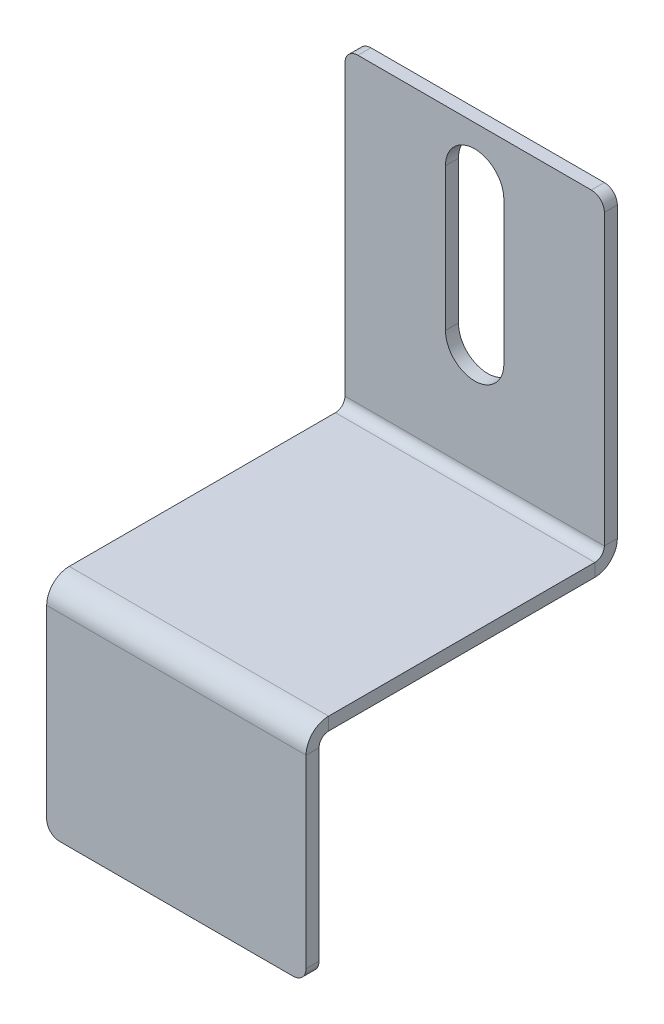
ISO-10303-21;
HEADER;
FILE_DESCRIPTION(('STEP AP214'),'2;1');
FILE_NAME('part.step','',(''),(''),'','','');
FILE_SCHEMA(('AUTOMOTIVE_DESIGN { 1 0 10303 214 1 1 1 1 }'));
ENDSEC;
DATA;
#1=APPLICATION_CONTEXT('core data for automotive mechanical design processes');
#2=APPLICATION_PROTOCOL_DEFINITION('international standard','automotive_design',2000,#1);
#3=PRODUCT_CONTEXT('',#1,'mechanical');
#4=PRODUCT('Part','Part','',(#3));
#5=PRODUCT_RELATED_PRODUCT_CATEGORY('part','',(#4));
#6=PRODUCT_DEFINITION_FORMATION('','',#4);
#7=PRODUCT_DEFINITION_CONTEXT('part definition',#1,'design');
#8=PRODUCT_DEFINITION('design','',#6,#7);
#9=PRODUCT_DEFINITION_SHAPE('','',#8);
#10=(LENGTH_UNIT() NAMED_UNIT(*) SI_UNIT(.MILLI.,.METRE.));
#11=(NAMED_UNIT(*) PLANE_ANGLE_UNIT() SI_UNIT($,.RADIAN.));
#12=(NAMED_UNIT(*) SI_UNIT($,.STERADIAN.) SOLID_ANGLE_UNIT());
#13=UNCERTAINTY_MEASURE_WITH_UNIT(LENGTH_MEASURE(1.E-05),#10,'distance_accuracy_value','');
#14=(GEOMETRIC_REPRESENTATION_CONTEXT(3) GLOBAL_UNCERTAINTY_ASSIGNED_CONTEXT((#13)) GLOBAL_UNIT_ASSIGNED_CONTEXT((#10,
#11,#12)) REPRESENTATION_CONTEXT('',''));
#15=CARTESIAN_POINT('',(0.,0.,0.));
#16=DIRECTION('',(0.,0.,1.));
#17=DIRECTION('',(1.,0.,0.));
#18=AXIS2_PLACEMENT_3D('',#15,#16,#17);
#19=CARTESIAN_POINT('',(20.,-25.,1.7366));
#20=DIRECTION('',(1.,0.,0.));
#21=DIRECTION('',(0.,0.,-1.));
#22=AXIS2_PLACEMENT_3D('',#19,#20,#21);
#23=PLANE('',#22);
#24=DIRECTION('',(0.,1.,0.));
#25=VECTOR('',#24,1.);
#26=CARTESIAN_POINT('',(20.,-25.,1.7366));
#27=LINE('',#26,#25);
#28=CARTESIAN_POINT('',(20.,-25.,1.7366));
#29=VERTEX_POINT('',#28);
#30=CARTESIAN_POINT('',(20.,-24.,1.7366));
#31=VERTEX_POINT('',#30);
#32=EDGE_CURVE('E309',#29,#31,#27,.T.);
#33=ORIENTED_EDGE('',*,*,#32,.F.);
#34=CARTESIAN_POINT('',(20.,-23.2634,1.7366));
#35=DIRECTION('',(1.,0.,0.));
#36=DIRECTION('',(0.,0.,-1.));
#37=AXIS2_PLACEMENT_3D('',#34,#35,#36);
#38=CIRCLE('',#37,1.7366);
#39=CARTESIAN_POINT('',(20.,-23.2634,0.));
#40=VERTEX_POINT('',#39);
#41=EDGE_CURVE('E215',#40,#29,#38,.F.);
#42=ORIENTED_EDGE('',*,*,#41,.F.);
#43=DIRECTION('',(0.,0.,-1.));
#44=VECTOR('',#43,1.);
#45=CARTESIAN_POINT('',(20.,-23.2634,0.999999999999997));
#46=LINE('',#45,#44);
#47=CARTESIAN_POINT('',(20.,-23.2634,0.999999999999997));
#48=VERTEX_POINT('',#47);
#49=EDGE_CURVE('E306',#48,#40,#46,.T.);
#50=ORIENTED_EDGE('',*,*,#49,.F.);
#51=CARTESIAN_POINT('',(20.,-23.2634,1.7366));
#52=DIRECTION('',(1.,0.,0.));
#53=DIRECTION('',(0.,0.,-1.));
#54=AXIS2_PLACEMENT_3D('',#51,#52,#53);
#55=CIRCLE('',#54,0.7366);
#56=EDGE_CURVE('E222',#48,#31,#55,.F.);
#57=ORIENTED_EDGE('',*,*,#56,.T.);
#58=EDGE_LOOP('',(#33,#42,#50,#57));
#59=FACE_BOUND('',#58,.T.);
#60=ADVANCED_FACE('F36',(#59),#23,.T.);
#61=CARTESIAN_POINT('',(20.,-23.2634,0.999999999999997));
#62=DIRECTION('',(1.,0.,0.));
#63=DIRECTION('',(0.,0.,-1.));
#64=AXIS2_PLACEMENT_3D('',#61,#62,#63);
#65=PLANE('',#64);
#66=DIRECTION('',(0.,0.,1.));
#67=VECTOR('',#66,1.);
#68=CARTESIAN_POINT('',(20.,-25.,0.));
#69=LINE('',#68,#67);
#70=CARTESIAN_POINT('',(20.,-25.,22.2634));
#71=VERTEX_POINT('',#70);
#72=EDGE_CURVE('E212',#29,#71,#69,.T.);
#73=ORIENTED_EDGE('',*,*,#72,.F.);
#74=ORIENTED_EDGE('',*,*,#32,.T.);
#75=DIRECTION('',(0.,0.,-1.));
#76=VECTOR('',#75,1.);
#77=CARTESIAN_POINT('',(20.,-24.,0.));
#78=LINE('',#77,#76);
#79=CARTESIAN_POINT('',(20.,-24.,22.2634));
#80=VERTEX_POINT('',#79);
#81=EDGE_CURVE('E225',#31,#80,#78,.F.);
#82=ORIENTED_EDGE('',*,*,#81,.T.);
#83=DIRECTION('',(0.,-1.,0.));
#84=VECTOR('',#83,1.);
#85=CARTESIAN_POINT('',(20.,-24.,22.2634));
#86=LINE('',#85,#84);
#87=EDGE_CURVE('E297',#80,#71,#86,.T.);
#88=ORIENTED_EDGE('',*,*,#87,.T.);
#89=EDGE_LOOP('',(#73,#74,#82,#88));
#90=FACE_BOUND('',#89,.T.);
#91=ADVANCED_FACE('F369',(#90),#65,.T.);
#92=CARTESIAN_POINT('',(0.,-23.2634,0.));
#93=DIRECTION('',(-1.,0.,0.));
#94=DIRECTION('',(0.,0.,1.));
#95=AXIS2_PLACEMENT_3D('',#92,#93,#94);
#96=PLANE('',#95);
#97=DIRECTION('',(0.,0.,1.));
#98=VECTOR('',#97,1.);
#99=CARTESIAN_POINT('',(0.,-23.2634,0.));
#100=LINE('',#99,#98);
#101=CARTESIAN_POINT('',(0.,-23.2634,0.));
#102=VERTEX_POINT('',#101);
#103=CARTESIAN_POINT('',(0.,-23.2634,0.999999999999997));
#104=VERTEX_POINT('',#103);
#105=EDGE_CURVE('E303',#102,#104,#100,.T.);
#106=ORIENTED_EDGE('',*,*,#105,.F.);
#107=CARTESIAN_POINT('',(0.,-23.2634,1.7366));
#108=DIRECTION('',(1.,0.,0.));
#109=DIRECTION('',(0.,0.,-1.));
#110=AXIS2_PLACEMENT_3D('',#107,#108,#109);
#111=CIRCLE('',#110,1.7366);
#112=CARTESIAN_POINT('',(0.,-25.,1.7366));
#113=VERTEX_POINT('',#112);
#114=EDGE_CURVE('E243',#102,#113,#111,.F.);
#115=ORIENTED_EDGE('',*,*,#114,.T.);
#116=DIRECTION('',(0.,-1.,0.));
#117=VECTOR('',#116,1.);
#118=CARTESIAN_POINT('',(0.,-24.,1.7366));
#119=LINE('',#118,#117);
#120=CARTESIAN_POINT('',(0.,-24.,1.7366));
#121=VERTEX_POINT('',#120);
#122=EDGE_CURVE('E301',#121,#113,#119,.T.);
#123=ORIENTED_EDGE('',*,*,#122,.F.);
#124=CARTESIAN_POINT('',(0.,-23.2634,1.7366));
#125=DIRECTION('',(1.,0.,0.));
#126=DIRECTION('',(0.,0.,-1.));
#127=AXIS2_PLACEMENT_3D('',#124,#125,#126);
#128=CIRCLE('',#127,0.7366);
#129=EDGE_CURVE('E250',#104,#121,#128,.F.);
#130=ORIENTED_EDGE('',*,*,#129,.F.);
#131=EDGE_LOOP('',(#106,#115,#123,#130));
#132=FACE_BOUND('',#131,.T.);
#133=ADVANCED_FACE('F375',(#132),#96,.T.);
#134=CARTESIAN_POINT('',(0.,-24.,1.7366));
#135=DIRECTION('',(-1.,0.,0.));
#136=DIRECTION('',(0.,0.,1.));
#137=AXIS2_PLACEMENT_3D('',#134,#135,#136);
#138=PLANE('',#137);
#139=DIRECTION('',(0.,-1.,0.));
#140=VECTOR('',#139,1.);
#141=CARTESIAN_POINT('',(0.,0.,1.));
#142=LINE('',#141,#140);
#143=CARTESIAN_POINT('',(0.,-1.,1.));
#144=VERTEX_POINT('',#143);
#145=EDGE_CURVE('E248',#144,#104,#142,.T.);
#146=ORIENTED_EDGE('',*,*,#145,.F.);
#147=DIRECTION('',(0.,0.,-1.));
#148=VECTOR('',#147,1.);
#149=CARTESIAN_POINT('',(0.,-1.,1.7366));
#150=LINE('',#149,#148);
#151=CARTESIAN_POINT('',(0.,-1.,0.));
#152=VERTEX_POINT('',#151);
#153=EDGE_CURVE('E329',#144,#152,#150,.T.);
#154=ORIENTED_EDGE('',*,*,#153,.T.);
#155=DIRECTION('',(0.,-1.,0.));
#156=VECTOR('',#155,1.);
#157=CARTESIAN_POINT('',(0.,0.,0.));
#158=LINE('',#157,#156);
#159=EDGE_CURVE('E246',#152,#102,#158,.T.);
#160=ORIENTED_EDGE('',*,*,#159,.T.);
#161=ORIENTED_EDGE('',*,*,#105,.T.);
#162=EDGE_LOOP('',(#146,#154,#160,#161));
#163=FACE_BOUND('',#162,.T.);
#164=ADVANCED_FACE('F399',(#163),#138,.T.);
#165=CARTESIAN_POINT('',(20.,-25.7366,23.));
#166=DIRECTION('',(1.,0.,0.));
#167=DIRECTION('',(0.,0.,-1.));
#168=AXIS2_PLACEMENT_3D('',#165,#166,#167);
#169=PLANE('',#168);
#170=DIRECTION('',(0.,0.,1.));
#171=VECTOR('',#170,1.);
#172=CARTESIAN_POINT('',(20.,-25.7366,23.));
#173=LINE('',#172,#171);
#174=CARTESIAN_POINT('',(20.,-25.7366,23.));
#175=VERTEX_POINT('',#174);
#176=CARTESIAN_POINT('',(20.,-25.7366,24.));
#177=VERTEX_POINT('',#176);
#178=EDGE_CURVE('E299',#175,#177,#173,.T.);
#179=ORIENTED_EDGE('',*,*,#178,.F.);
#180=CARTESIAN_POINT('',(20.,-25.7366,22.2634));
#181=DIRECTION('',(-1.,0.,0.));
#182=DIRECTION('',(0.,0.,1.));
#183=AXIS2_PLACEMENT_3D('',#180,#181,#182);
#184=CIRCLE('',#183,0.7366);
#185=EDGE_CURVE('E209',#71,#175,#184,.F.);
#186=ORIENTED_EDGE('',*,*,#185,.F.);
#187=ORIENTED_EDGE('',*,*,#87,.F.);
#188=CARTESIAN_POINT('',(20.,-25.7366,22.2634));
#189=DIRECTION('',(1.,0.,0.));
#190=DIRECTION('',(0.,0.,-1.));
#191=AXIS2_PLACEMENT_3D('',#188,#189,#190);
#192=CIRCLE('',#191,1.7366);
#193=EDGE_CURVE('E228',#80,#177,#192,.T.);
#194=ORIENTED_EDGE('',*,*,#193,.T.);
#195=EDGE_LOOP('',(#179,#186,#187,#194));
#196=FACE_BOUND('',#195,.T.);
#197=ADVANCED_FACE('F442',(#196),#169,.T.);
#198=CARTESIAN_POINT('',(20.,-24.,22.2634));
#199=DIRECTION('',(1.,0.,0.));
#200=DIRECTION('',(0.,0.,-1.));
#201=AXIS2_PLACEMENT_3D('',#198,#199,#200);
#202=PLANE('',#201);
#203=DIRECTION('',(0.,-1.,0.));
#204=VECTOR('',#203,1.);
#205=CARTESIAN_POINT('',(20.,-25.,24.));
#206=LINE('',#205,#204);
#207=CARTESIAN_POINT('',(20.,-40.,24.));
#208=VERTEX_POINT('',#207);
#209=EDGE_CURVE('E202',#177,#208,#206,.T.);
#210=ORIENTED_EDGE('',*,*,#209,.T.);
#211=DIRECTION('',(0.,0.,1.));
#212=VECTOR('',#211,1.);
#213=CARTESIAN_POINT('',(20.,-40.,22.2634));
#214=LINE('',#213,#212);
#215=CARTESIAN_POINT('',(20.,-40.,23.));
#216=VERTEX_POINT('',#215);
#217=EDGE_CURVE('E327',#208,#216,#214,.F.);
#218=ORIENTED_EDGE('',*,*,#217,.T.);
#219=DIRECTION('',(0.,-1.,0.));
#220=VECTOR('',#219,1.);
#221=CARTESIAN_POINT('',(20.,-25.,23.));
#222=LINE('',#221,#220);
#223=EDGE_CURVE('E205',#175,#216,#222,.T.);
#224=ORIENTED_EDGE('',*,*,#223,.F.);
#225=ORIENTED_EDGE('',*,*,#178,.T.);
#226=EDGE_LOOP('',(#210,#218,#224,#225));
#227=FACE_BOUND('',#226,.T.);
#228=ADVANCED_FACE('F485',(#227),#202,.T.);
#229=CARTESIAN_POINT('',(0.,-25.,22.2634));
#230=DIRECTION('',(-1.,0.,0.));
#231=DIRECTION('',(0.,0.,1.));
#232=AXIS2_PLACEMENT_3D('',#229,#230,#231);
#233=PLANE('',#232);
#234=DIRECTION('',(0.,1.,0.));
#235=VECTOR('',#234,1.);
#236=CARTESIAN_POINT('',(0.,-25.,22.2634));
#237=LINE('',#236,#235);
#238=CARTESIAN_POINT('',(0.,-25.,22.2634));
#239=VERTEX_POINT('',#238);
#240=CARTESIAN_POINT('',(0.,-24.,22.2634));
#241=VERTEX_POINT('',#240);
#242=EDGE_CURVE('E295',#239,#241,#237,.T.);
#243=ORIENTED_EDGE('',*,*,#242,.F.);
#244=CARTESIAN_POINT('',(0.,-25.7366,22.2634));
#245=DIRECTION('',(-1.,0.,0.));
#246=DIRECTION('',(0.,0.,1.));
#247=AXIS2_PLACEMENT_3D('',#244,#245,#246);
#248=CIRCLE('',#247,0.7366);
#249=CARTESIAN_POINT('',(0.,-25.7366,23.));
#250=VERTEX_POINT('',#249);
#251=EDGE_CURVE('E237',#239,#250,#248,.F.);
#252=ORIENTED_EDGE('',*,*,#251,.T.);
#253=DIRECTION('',(0.,0.,-1.));
#254=VECTOR('',#253,1.);
#255=CARTESIAN_POINT('',(0.,-25.7366,24.));
#256=LINE('',#255,#254);
#257=CARTESIAN_POINT('',(0.,-25.7366,24.));
#258=VERTEX_POINT('',#257);
#259=EDGE_CURVE('E293',#258,#250,#256,.T.);
#260=ORIENTED_EDGE('',*,*,#259,.F.);
#261=CARTESIAN_POINT('',(0.,-25.7366,22.2634));
#262=DIRECTION('',(1.,0.,0.));
#263=DIRECTION('',(0.,0.,-1.));
#264=AXIS2_PLACEMENT_3D('',#261,#262,#263);
#265=CIRCLE('',#264,1.7366);
#266=EDGE_CURVE('E206',#241,#258,#265,.T.);
#267=ORIENTED_EDGE('',*,*,#266,.F.);
#268=EDGE_LOOP('',(#243,#252,#260,#267));
#269=FACE_BOUND('',#268,.T.);
#270=ADVANCED_FACE('F430',(#269),#233,.T.);
#271=CARTESIAN_POINT('',(0.,-25.7366,24.));
#272=DIRECTION('',(-1.,0.,0.));
#273=DIRECTION('',(0.,0.,1.));
#274=AXIS2_PLACEMENT_3D('',#271,#272,#273);
#275=PLANE('',#274);
#276=DIRECTION('',(0.,0.,1.));
#277=VECTOR('',#276,1.);
#278=CARTESIAN_POINT('',(0.,-25.,0.));
#279=LINE('',#278,#277);
#280=EDGE_CURVE('E240',#113,#239,#279,.T.);
#281=ORIENTED_EDGE('',*,*,#280,.T.);
#282=ORIENTED_EDGE('',*,*,#242,.T.);
#283=DIRECTION('',(0.,0.,-1.));
#284=VECTOR('',#283,1.);
#285=CARTESIAN_POINT('',(0.,-24.,0.));
#286=LINE('',#285,#284);
#287=EDGE_CURVE('E253',#121,#241,#286,.F.);
#288=ORIENTED_EDGE('',*,*,#287,.F.);
#289=ORIENTED_EDGE('',*,*,#122,.T.);
#290=EDGE_LOOP('',(#281,#282,#288,#289));
#291=FACE_BOUND('',#290,.T.);
#292=ADVANCED_FACE('F412',(#291),#275,.T.);
#293=CARTESIAN_POINT('',(20.,-25.,24.));
#294=DIRECTION('',(0.,0.,-1.));
#295=DIRECTION('',(0.,1.,0.));
#296=AXIS2_PLACEMENT_3D('',#293,#294,#295);
#297=PLANE('',#296);
#298=DIRECTION('',(0.,-1.,0.));
#299=VECTOR('',#298,1.);
#300=CARTESIAN_POINT('',(0.,-25.,24.));
#301=LINE('',#300,#299);
#302=CARTESIAN_POINT('',(0.,-40.,24.));
#303=VERTEX_POINT('',#302);
#304=EDGE_CURVE('E199',#258,#303,#301,.T.);
#305=ORIENTED_EDGE('',*,*,#304,.T.);
#306=CARTESIAN_POINT('',(1.,-40.,24.));
#307=DIRECTION('',(0.,0.,-1.));
#308=DIRECTION('',(0.,1.,0.));
#309=AXIS2_PLACEMENT_3D('',#306,#307,#308);
#310=CIRCLE('',#309,1.);
#311=CARTESIAN_POINT('',(1.,-41.,24.));
#312=VERTEX_POINT('',#311);
#313=EDGE_CURVE('E316',#303,#312,#310,.F.);
#314=ORIENTED_EDGE('',*,*,#313,.T.);
#315=DIRECTION('',(-1.,0.,0.));
#316=VECTOR('',#315,1.);
#317=CARTESIAN_POINT('',(20.,-41.,24.));
#318=LINE('',#317,#316);
#319=CARTESIAN_POINT('',(19.,-41.,24.));
#320=VERTEX_POINT('',#319);
#321=EDGE_CURVE('E290',#320,#312,#318,.T.);
#322=ORIENTED_EDGE('',*,*,#321,.F.);
#323=CARTESIAN_POINT('',(19.,-40.,24.));
#324=DIRECTION('',(0.,0.,-1.));
#325=DIRECTION('',(0.,1.,0.));
#326=AXIS2_PLACEMENT_3D('',#323,#324,#325);
#327=CIRCLE('',#326,1.);
#328=EDGE_CURVE('E314',#320,#208,#327,.F.);
#329=ORIENTED_EDGE('',*,*,#328,.T.);
#330=ORIENTED_EDGE('',*,*,#209,.F.);
#331=DIRECTION('',(-1.,0.,0.));
#332=VECTOR('',#331,1.);
#333=CARTESIAN_POINT('',(20.,-25.7366,24.));
#334=LINE('',#333,#332);
#335=EDGE_CURVE('E231',#177,#258,#334,.T.);
#336=ORIENTED_EDGE('',*,*,#335,.T.);
#337=EDGE_LOOP('',(#305,#314,#322,#329,#330,#336));
#338=FACE_BOUND('',#337,.T.);
#339=ADVANCED_FACE('F476',(#338),#297,.F.);
#340=CARTESIAN_POINT('',(20.,-41.,23.));
#341=DIRECTION('',(0.,-1.,0.));
#342=DIRECTION('',(0.,0.,-1.));
#343=AXIS2_PLACEMENT_3D('',#340,#341,#342);
#344=PLANE('',#343);
#345=ORIENTED_EDGE('',*,*,#321,.T.);
#346=DIRECTION('',(0.,0.,1.));
#347=VECTOR('',#346,1.);
#348=CARTESIAN_POINT('',(1.,-41.,23.));
#349=LINE('',#348,#347);
#350=CARTESIAN_POINT('',(1.,-41.,23.));
#351=VERTEX_POINT('',#350);
#352=EDGE_CURVE('E321',#312,#351,#349,.F.);
#353=ORIENTED_EDGE('',*,*,#352,.T.);
#354=DIRECTION('',(-1.,0.,0.));
#355=VECTOR('',#354,1.);
#356=CARTESIAN_POINT('',(20.,-41.,23.));
#357=LINE('',#356,#355);
#358=CARTESIAN_POINT('',(19.,-41.,23.));
#359=VERTEX_POINT('',#358);
#360=EDGE_CURVE('E287',#359,#351,#357,.T.);
#361=ORIENTED_EDGE('',*,*,#360,.F.);
#362=DIRECTION('',(0.,0.,1.));
#363=VECTOR('',#362,1.);
#364=CARTESIAN_POINT('',(19.,-41.,23.));
#365=LINE('',#364,#363);
#366=EDGE_CURVE('E318',#359,#320,#365,.T.);
#367=ORIENTED_EDGE('',*,*,#366,.T.);
#368=EDGE_LOOP('',(#345,#353,#361,#367));
#369=FACE_BOUND('',#368,.T.);
#370=ADVANCED_FACE('F472',(#369),#344,.T.);
#371=CARTESIAN_POINT('',(20.,-25.,23.));
#372=DIRECTION('',(0.,0.,-1.));
#373=DIRECTION('',(0.,1.,0.));
#374=AXIS2_PLACEMENT_3D('',#371,#372,#373);
#375=PLANE('',#374);
#376=ORIENTED_EDGE('',*,*,#360,.T.);
#377=CARTESIAN_POINT('',(1.,-40.,23.));
#378=DIRECTION('',(0.,0.,-1.));
#379=DIRECTION('',(0.,1.,0.));
#380=AXIS2_PLACEMENT_3D('',#377,#378,#379);
#381=CIRCLE('',#380,1.);
#382=CARTESIAN_POINT('',(0.,-40.,23.));
#383=VERTEX_POINT('',#382);
#384=EDGE_CURVE('E325',#351,#383,#381,.T.);
#385=ORIENTED_EDGE('',*,*,#384,.T.);
#386=DIRECTION('',(0.,-1.,0.));
#387=VECTOR('',#386,1.);
#388=CARTESIAN_POINT('',(0.,-25.,23.));
#389=LINE('',#388,#387);
#390=EDGE_CURVE('E234',#250,#383,#389,.T.);
#391=ORIENTED_EDGE('',*,*,#390,.F.);
#392=DIRECTION('',(-1.,0.,0.));
#393=VECTOR('',#392,1.);
#394=CARTESIAN_POINT('',(20.,-25.7366,23.));
#395=LINE('',#394,#393);
#396=EDGE_CURVE('E284',#175,#250,#395,.T.);
#397=ORIENTED_EDGE('',*,*,#396,.F.);
#398=ORIENTED_EDGE('',*,*,#223,.T.);
#399=CARTESIAN_POINT('',(19.,-40.,23.));
#400=DIRECTION('',(0.,0.,-1.));
#401=DIRECTION('',(0.,1.,0.));
#402=AXIS2_PLACEMENT_3D('',#399,#400,#401);
#403=CIRCLE('',#402,1.);
#404=EDGE_CURVE('E323',#216,#359,#403,.T.);
#405=ORIENTED_EDGE('',*,*,#404,.T.);
#406=EDGE_LOOP('',(#376,#385,#391,#397,#398,#405));
#407=FACE_BOUND('',#406,.T.);
#408=ADVANCED_FACE('F469',(#407),#375,.T.);
#409=CARTESIAN_POINT('',(20.,-25.7366,22.2634));
#410=DIRECTION('',(-1.,0.,0.));
#411=DIRECTION('',(0.,0.,1.));
#412=AXIS2_PLACEMENT_3D('',#409,#410,#411);
#413=CYLINDRICAL_SURFACE('',#412,0.7366);
#414=ORIENTED_EDGE('',*,*,#251,.F.);
#415=DIRECTION('',(-1.,0.,0.));
#416=VECTOR('',#415,1.);
#417=CARTESIAN_POINT('',(20.,-25.,22.2634));
#418=LINE('',#417,#416);
#419=EDGE_CURVE('E281',#71,#239,#418,.T.);
#420=ORIENTED_EDGE('',*,*,#419,.F.);
#421=ORIENTED_EDGE('',*,*,#185,.T.);
#422=ORIENTED_EDGE('',*,*,#396,.T.);
#423=EDGE_LOOP('',(#414,#420,#421,#422));
#424=FACE_BOUND('',#423,.T.);
#425=ADVANCED_FACE('F426',(#424),#413,.F.);
#426=CARTESIAN_POINT('',(20.,-25.,0.));
#427=DIRECTION('',(0.,-1.,0.));
#428=DIRECTION('',(0.,0.,-1.));
#429=AXIS2_PLACEMENT_3D('',#426,#427,#428);
#430=PLANE('',#429);
#431=ORIENTED_EDGE('',*,*,#280,.F.);
#432=DIRECTION('',(-1.,0.,0.));
#433=VECTOR('',#432,1.);
#434=CARTESIAN_POINT('',(20.,-25.,1.7366));
#435=LINE('',#434,#433);
#436=EDGE_CURVE('E278',#29,#113,#435,.T.);
#437=ORIENTED_EDGE('',*,*,#436,.F.);
#438=ORIENTED_EDGE('',*,*,#72,.T.);
#439=ORIENTED_EDGE('',*,*,#419,.T.);
#440=EDGE_LOOP('',(#431,#437,#438,#439));
#441=FACE_BOUND('',#440,.T.);
#442=ADVANCED_FACE('F421',(#441),#430,.T.);
#443=CARTESIAN_POINT('',(20.,-23.2634,1.7366));
#444=DIRECTION('',(-1.,0.,0.));
#445=DIRECTION('',(0.,0.,1.));
#446=AXIS2_PLACEMENT_3D('',#443,#444,#445);
#447=CYLINDRICAL_SURFACE('',#446,1.7366);
#448=ORIENTED_EDGE('',*,*,#114,.F.);
#449=DIRECTION('',(-1.,0.,0.));
#450=VECTOR('',#449,1.);
#451=CARTESIAN_POINT('',(20.,-23.2634,0.));
#452=LINE('',#451,#450);
#453=EDGE_CURVE('E275',#40,#102,#452,.T.);
#454=ORIENTED_EDGE('',*,*,#453,.F.);
#455=ORIENTED_EDGE('',*,*,#41,.T.);
#456=ORIENTED_EDGE('',*,*,#436,.T.);
#457=EDGE_LOOP('',(#448,#454,#455,#456));
#458=FACE_BOUND('',#457,.T.);
#459=ADVANCED_FACE('F416',(#458),#447,.T.);
#460=CARTESIAN_POINT('',(20.,0.,0.));
#461=DIRECTION('',(0.,0.,-1.));
#462=DIRECTION('',(0.,1.,0.));
#463=AXIS2_PLACEMENT_3D('',#460,#461,#462);
#464=PLANE('',#463);
#465=CARTESIAN_POINT('',(10.,-4.,0.));
#466=DIRECTION('',(0.,0.,-1.));
#467=DIRECTION('',(0.,1.,0.));
#468=AXIS2_PLACEMENT_3D('',#465,#466,#467);
#469=CIRCLE('',#468,2.25);
#470=CARTESIAN_POINT('',(7.75,-4.,0.));
#471=VERTEX_POINT('',#470);
#472=CARTESIAN_POINT('',(12.25,-4.,0.));
#473=VERTEX_POINT('',#472);
#474=EDGE_CURVE('E51',#471,#473,#469,.T.);
#475=ORIENTED_EDGE('',*,*,#474,.F.);
#476=DIRECTION('',(0.,1.,0.));
#477=VECTOR('',#476,1.);
#478=CARTESIAN_POINT('',(7.75,-4.,0.));
#479=LINE('',#478,#477);
#480=CARTESIAN_POINT('',(7.75,-15.,0.));
#481=VERTEX_POINT('',#480);
#482=EDGE_CURVE('E192',#481,#471,#479,.T.);
#483=ORIENTED_EDGE('',*,*,#482,.F.);
#484=CARTESIAN_POINT('',(10.,-15.,0.));
#485=DIRECTION('',(0.,0.,-1.));
#486=DIRECTION('',(0.,1.,0.));
#487=AXIS2_PLACEMENT_3D('',#484,#485,#486);
#488=CIRCLE('',#487,2.25);
#489=CARTESIAN_POINT('',(12.25,-15.,0.));
#490=VERTEX_POINT('',#489);
#491=EDGE_CURVE('E176',#490,#481,#488,.T.);
#492=ORIENTED_EDGE('',*,*,#491,.F.);
#493=DIRECTION('',(0.,-1.,0.));
#494=VECTOR('',#493,1.);
#495=CARTESIAN_POINT('',(12.25,-4.,0.));
#496=LINE('',#495,#494);
#497=EDGE_CURVE('E185',#473,#490,#496,.T.);
#498=ORIENTED_EDGE('',*,*,#497,.F.);
#499=EDGE_LOOP('',(#475,#483,#492,#498));
#500=FACE_BOUND('',#499,.T.);
#501=ORIENTED_EDGE('',*,*,#159,.F.);
#502=CARTESIAN_POINT('',(1.,-1.,0.));
#503=DIRECTION('',(0.,0.,-1.));
#504=DIRECTION('',(0.,1.,0.));
#505=AXIS2_PLACEMENT_3D('',#502,#503,#504);
#506=CIRCLE('',#505,1.);
#507=CARTESIAN_POINT('',(1.,0.,0.));
#508=VERTEX_POINT('',#507);
#509=EDGE_CURVE('E334',#152,#508,#506,.T.);
#510=ORIENTED_EDGE('',*,*,#509,.T.);
#511=DIRECTION('',(-1.,0.,0.));
#512=VECTOR('',#511,1.);
#513=CARTESIAN_POINT('',(20.,0.,0.));
#514=LINE('',#513,#512);
#515=CARTESIAN_POINT('',(19.,0.,0.));
#516=VERTEX_POINT('',#515);
#517=EDGE_CURVE('E272',#516,#508,#514,.T.);
#518=ORIENTED_EDGE('',*,*,#517,.F.);
#519=CARTESIAN_POINT('',(19.,-1.,0.));
#520=DIRECTION('',(0.,0.,-1.));
#521=DIRECTION('',(0.,1.,0.));
#522=AXIS2_PLACEMENT_3D('',#519,#520,#521);
#523=CIRCLE('',#522,1.);
#524=CARTESIAN_POINT('',(20.,-1.,0.));
#525=VERTEX_POINT('',#524);
#526=EDGE_CURVE('E332',#516,#525,#523,.T.);
#527=ORIENTED_EDGE('',*,*,#526,.T.);
#528=DIRECTION('',(0.,-1.,0.));
#529=VECTOR('',#528,1.);
#530=CARTESIAN_POINT('',(20.,0.,0.));
#531=LINE('',#530,#529);
#532=EDGE_CURVE('E218',#525,#40,#531,.T.);
#533=ORIENTED_EDGE('',*,*,#532,.T.);
#534=ORIENTED_EDGE('',*,*,#453,.T.);
#535=EDGE_LOOP('',(#501,#510,#518,#527,#533,#534));
#536=FACE_BOUND('',#535,.T.);
#537=ADVANCED_FACE('F189',(#500,#536),#464,.T.);
#538=CARTESIAN_POINT('',(20.,0.,1.));
#539=DIRECTION('',(0.,1.,0.));
#540=DIRECTION('',(0.,0.,1.));
#541=AXIS2_PLACEMENT_3D('',#538,#539,#540);
#542=PLANE('',#541);
#543=ORIENTED_EDGE('',*,*,#517,.T.);
#544=DIRECTION('',(0.,0.,-1.));
#545=VECTOR('',#544,1.);
#546=CARTESIAN_POINT('',(1.,0.,1.));
#547=LINE('',#546,#545);
#548=CARTESIAN_POINT('',(1.,0.,1.));
#549=VERTEX_POINT('',#548);
#550=EDGE_CURVE('E339',#508,#549,#547,.F.);
#551=ORIENTED_EDGE('',*,*,#550,.T.);
#552=DIRECTION('',(-1.,0.,0.));
#553=VECTOR('',#552,1.);
#554=CARTESIAN_POINT('',(20.,0.,1.));
#555=LINE('',#554,#553);
#556=CARTESIAN_POINT('',(19.,0.,1.));
#557=VERTEX_POINT('',#556);
#558=EDGE_CURVE('E269',#557,#549,#555,.T.);
#559=ORIENTED_EDGE('',*,*,#558,.F.);
#560=DIRECTION('',(0.,0.,-1.));
#561=VECTOR('',#560,1.);
#562=CARTESIAN_POINT('',(19.,0.,0.));
#563=LINE('',#562,#561);
#564=EDGE_CURVE('E336',#557,#516,#563,.T.);
#565=ORIENTED_EDGE('',*,*,#564,.T.);
#566=EDGE_LOOP('',(#543,#551,#559,#565));
#567=FACE_BOUND('',#566,.T.);
#568=ADVANCED_FACE('F452',(#567),#542,.T.);
#569=CARTESIAN_POINT('',(20.,0.,1.));
#570=DIRECTION('',(0.,0.,-1.));
#571=DIRECTION('',(0.,1.,0.));
#572=AXIS2_PLACEMENT_3D('',#569,#570,#571);
#573=PLANE('',#572);
#574=DIRECTION('',(0.,1.,0.));
#575=VECTOR('',#574,1.);
#576=CARTESIAN_POINT('',(7.75,0.,1.));
#577=LINE('',#576,#575);
#578=CARTESIAN_POINT('',(7.75,-15.,1.));
#579=VERTEX_POINT('',#578);
#580=CARTESIAN_POINT('',(7.75,-4.,1.));
#581=VERTEX_POINT('',#580);
#582=EDGE_CURVE('E44',#579,#581,#577,.T.);
#583=ORIENTED_EDGE('',*,*,#582,.T.);
#584=CARTESIAN_POINT('',(10.,-4.,1.));
#585=DIRECTION('',(0.,0.,-1.));
#586=DIRECTION('',(0.,1.,0.));
#587=AXIS2_PLACEMENT_3D('',#584,#585,#586);
#588=CIRCLE('',#587,2.25);
#589=CARTESIAN_POINT('',(12.25,-4.,1.));
#590=VERTEX_POINT('',#589);
#591=EDGE_CURVE('E11',#581,#590,#588,.T.);
#592=ORIENTED_EDGE('',*,*,#591,.T.);
#593=DIRECTION('',(0.,-1.,0.));
#594=VECTOR('',#593,1.);
#595=CARTESIAN_POINT('',(12.25,0.,1.));
#596=LINE('',#595,#594);
#597=CARTESIAN_POINT('',(12.25,-15.,0.999999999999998));
#598=VERTEX_POINT('',#597);
#599=EDGE_CURVE('E347',#590,#598,#596,.T.);
#600=ORIENTED_EDGE('',*,*,#599,.T.);
#601=CARTESIAN_POINT('',(10.,-15.,0.999999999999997));
#602=DIRECTION('',(0.,0.,-1.));
#603=DIRECTION('',(0.,1.,0.));
#604=AXIS2_PLACEMENT_3D('',#601,#602,#603);
#605=CIRCLE('',#604,2.25);
#606=EDGE_CURVE('E179',#598,#579,#605,.T.);
#607=ORIENTED_EDGE('',*,*,#606,.T.);
#608=EDGE_LOOP('',(#583,#592,#600,#607));
#609=FACE_BOUND('',#608,.T.);
#610=ORIENTED_EDGE('',*,*,#558,.T.);
#611=CARTESIAN_POINT('',(1.,-1.,1.));
#612=DIRECTION('',(0.,0.,-1.));
#613=DIRECTION('',(0.,1.,0.));
#614=AXIS2_PLACEMENT_3D('',#611,#612,#613);
#615=CIRCLE('',#614,1.);
#616=EDGE_CURVE('E343',#549,#144,#615,.F.);
#617=ORIENTED_EDGE('',*,*,#616,.T.);
#618=ORIENTED_EDGE('',*,*,#145,.T.);
#619=DIRECTION('',(-1.,0.,0.));
#620=VECTOR('',#619,1.);
#621=CARTESIAN_POINT('',(20.,-23.2634,0.999999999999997));
#622=LINE('',#621,#620);
#623=EDGE_CURVE('E266',#48,#104,#622,.T.);
#624=ORIENTED_EDGE('',*,*,#623,.F.);
#625=DIRECTION('',(0.,-1.,0.));
#626=VECTOR('',#625,1.);
#627=CARTESIAN_POINT('',(20.,0.,1.));
#628=LINE('',#627,#626);
#629=CARTESIAN_POINT('',(20.,-1.,1.));
#630=VERTEX_POINT('',#629);
#631=EDGE_CURVE('E220',#630,#48,#628,.T.);
#632=ORIENTED_EDGE('',*,*,#631,.F.);
#633=CARTESIAN_POINT('',(19.,-1.,1.));
#634=DIRECTION('',(0.,0.,-1.));
#635=DIRECTION('',(0.,1.,0.));
#636=AXIS2_PLACEMENT_3D('',#633,#634,#635);
#637=CIRCLE('',#636,1.);
#638=EDGE_CURVE('E341',#630,#557,#637,.F.);
#639=ORIENTED_EDGE('',*,*,#638,.T.);
#640=EDGE_LOOP('',(#610,#617,#618,#624,#632,#639));
#641=FACE_BOUND('',#640,.T.);
#642=ADVANCED_FACE('F351',(#609,#641),#573,.F.);
#643=CARTESIAN_POINT('',(20.,-23.2634,1.7366));
#644=DIRECTION('',(-1.,0.,0.));
#645=DIRECTION('',(0.,0.,1.));
#646=AXIS2_PLACEMENT_3D('',#643,#644,#645);
#647=CYLINDRICAL_SURFACE('',#646,0.7366);
#648=ORIENTED_EDGE('',*,*,#129,.T.);
#649=DIRECTION('',(-1.,0.,0.));
#650=VECTOR('',#649,1.);
#651=CARTESIAN_POINT('',(20.,-24.,1.7366));
#652=LINE('',#651,#650);
#653=EDGE_CURVE('E263',#31,#121,#652,.T.);
#654=ORIENTED_EDGE('',*,*,#653,.F.);
#655=ORIENTED_EDGE('',*,*,#56,.F.);
#656=ORIENTED_EDGE('',*,*,#623,.T.);
#657=EDGE_LOOP('',(#648,#654,#655,#656));
#658=FACE_BOUND('',#657,.T.);
#659=ADVANCED_FACE('F406',(#658),#647,.F.);
#660=CARTESIAN_POINT('',(20.,-24.,0.));
#661=DIRECTION('',(0.,-1.,0.));
#662=DIRECTION('',(0.,0.,-1.));
#663=AXIS2_PLACEMENT_3D('',#660,#661,#662);
#664=PLANE('',#663);
#665=ORIENTED_EDGE('',*,*,#287,.T.);
#666=DIRECTION('',(-1.,0.,0.));
#667=VECTOR('',#666,1.);
#668=CARTESIAN_POINT('',(20.,-24.,22.2634));
#669=LINE('',#668,#667);
#670=EDGE_CURVE('E260',#80,#241,#669,.T.);
#671=ORIENTED_EDGE('',*,*,#670,.F.);
#672=ORIENTED_EDGE('',*,*,#81,.F.);
#673=ORIENTED_EDGE('',*,*,#653,.T.);
#674=EDGE_LOOP('',(#665,#671,#672,#673));
#675=FACE_BOUND('',#674,.T.);
#676=ADVANCED_FACE('F434',(#675),#664,.F.);
#677=CARTESIAN_POINT('',(20.,-25.7366,22.2634));
#678=DIRECTION('',(-1.,0.,0.));
#679=DIRECTION('',(0.,0.,1.));
#680=AXIS2_PLACEMENT_3D('',#677,#678,#679);
#681=CYLINDRICAL_SURFACE('',#680,1.7366);
#682=ORIENTED_EDGE('',*,*,#266,.T.);
#683=ORIENTED_EDGE('',*,*,#335,.F.);
#684=ORIENTED_EDGE('',*,*,#193,.F.);
#685=ORIENTED_EDGE('',*,*,#670,.T.);
#686=EDGE_LOOP('',(#682,#683,#684,#685));
#687=FACE_BOUND('',#686,.T.);
#688=ADVANCED_FACE('F438',(#687),#681,.T.);
#689=CARTESIAN_POINT('',(20.,-25.7366,22.2634));
#690=DIRECTION('',(-1.,0.,0.));
#691=DIRECTION('',(0.,0.,1.));
#692=AXIS2_PLACEMENT_3D('',#689,#690,#691);
#693=PLANE('',#692);
#694=ORIENTED_EDGE('',*,*,#532,.F.);
#695=DIRECTION('',(0.,0.,-1.));
#696=VECTOR('',#695,1.);
#697=CARTESIAN_POINT('',(20.,-1.,1.));
#698=LINE('',#697,#696);
#699=EDGE_CURVE('E345',#525,#630,#698,.F.);
#700=ORIENTED_EDGE('',*,*,#699,.T.);
#701=ORIENTED_EDGE('',*,*,#631,.T.);
#702=ORIENTED_EDGE('',*,*,#49,.T.);
#703=EDGE_LOOP('',(#694,#700,#701,#702));
#704=FACE_BOUND('',#703,.T.);
#705=ADVANCED_FACE('F446',(#704),#693,.F.);
#706=CARTESIAN_POINT('',(0.,-25.7366,22.2634));
#707=DIRECTION('',(-1.,0.,0.));
#708=DIRECTION('',(0.,0.,1.));
#709=AXIS2_PLACEMENT_3D('',#706,#707,#708);
#710=PLANE('',#709);
#711=ORIENTED_EDGE('',*,*,#390,.T.);
#712=DIRECTION('',(0.,0.,1.));
#713=VECTOR('',#712,1.);
#714=CARTESIAN_POINT('',(0.,-40.,22.2634));
#715=LINE('',#714,#713);
#716=EDGE_CURVE('E311',#383,#303,#715,.T.);
#717=ORIENTED_EDGE('',*,*,#716,.T.);
#718=ORIENTED_EDGE('',*,*,#304,.F.);
#719=ORIENTED_EDGE('',*,*,#259,.T.);
#720=EDGE_LOOP('',(#711,#717,#718,#719));
#721=FACE_BOUND('',#720,.T.);
#722=ADVANCED_FACE('F384',(#721),#710,.T.);
#723=CARTESIAN_POINT('',(1.,-40.,22.2634));
#724=DIRECTION('',(0.,0.,1.));
#725=DIRECTION('',(1.,0.,0.));
#726=AXIS2_PLACEMENT_3D('',#723,#724,#725);
#727=CYLINDRICAL_SURFACE('',#726,1.);
#728=ORIENTED_EDGE('',*,*,#384,.F.);
#729=ORIENTED_EDGE('',*,*,#352,.F.);
#730=ORIENTED_EDGE('',*,*,#313,.F.);
#731=ORIENTED_EDGE('',*,*,#716,.F.);
#732=EDGE_LOOP('',(#728,#729,#730,#731));
#733=FACE_BOUND('',#732,.T.);
#734=ADVANCED_FACE('F380',(#733),#727,.T.);
#735=CARTESIAN_POINT('',(19.,-40.,23.));
#736=DIRECTION('',(0.,0.,1.));
#737=DIRECTION('',(1.,0.,0.));
#738=AXIS2_PLACEMENT_3D('',#735,#736,#737);
#739=CYLINDRICAL_SURFACE('',#738,1.);
#740=ORIENTED_EDGE('',*,*,#404,.F.);
#741=ORIENTED_EDGE('',*,*,#217,.F.);
#742=ORIENTED_EDGE('',*,*,#328,.F.);
#743=ORIENTED_EDGE('',*,*,#366,.F.);
#744=EDGE_LOOP('',(#740,#741,#742,#743));
#745=FACE_BOUND('',#744,.T.);
#746=ADVANCED_FACE('F383',(#745),#739,.T.);
#747=CARTESIAN_POINT('',(1.,-1.,1.7366));
#748=DIRECTION('',(0.,0.,-1.));
#749=DIRECTION('',(0.,1.,0.));
#750=AXIS2_PLACEMENT_3D('',#747,#748,#749);
#751=CYLINDRICAL_SURFACE('',#750,1.);
#752=ORIENTED_EDGE('',*,*,#616,.F.);
#753=ORIENTED_EDGE('',*,*,#550,.F.);
#754=ORIENTED_EDGE('',*,*,#509,.F.);
#755=ORIENTED_EDGE('',*,*,#153,.F.);
#756=EDGE_LOOP('',(#752,#753,#754,#755));
#757=FACE_BOUND('',#756,.T.);
#758=ADVANCED_FACE('F364',(#757),#751,.T.);
#759=CARTESIAN_POINT('',(19.,-1.,1.));
#760=DIRECTION('',(0.,0.,1.));
#761=DIRECTION('',(0.,-1.,0.));
#762=AXIS2_PLACEMENT_3D('',#759,#760,#761);
#763=CYLINDRICAL_SURFACE('',#762,1.);
#764=ORIENTED_EDGE('',*,*,#638,.F.);
#765=ORIENTED_EDGE('',*,*,#699,.F.);
#766=ORIENTED_EDGE('',*,*,#526,.F.);
#767=ORIENTED_EDGE('',*,*,#564,.F.);
#768=EDGE_LOOP('',(#764,#765,#766,#767));
#769=FACE_BOUND('',#768,.T.);
#770=ADVANCED_FACE('F38',(#769),#763,.T.);
#771=CARTESIAN_POINT('',(10.,-4.,24.));
#772=DIRECTION('',(0.,0.,-1.));
#773=DIRECTION('',(0.,1.,0.));
#774=AXIS2_PLACEMENT_3D('',#771,#772,#773);
#775=CYLINDRICAL_SURFACE('',#774,2.25);
#776=DIRECTION('',(0.,0.,-1.));
#777=VECTOR('',#776,1.);
#778=CARTESIAN_POINT('',(7.75,-4.,24.));
#779=LINE('',#778,#777);
#780=EDGE_CURVE('E197',#581,#471,#779,.T.);
#781=ORIENTED_EDGE('',*,*,#780,.T.);
#782=ORIENTED_EDGE('',*,*,#474,.T.);
#783=DIRECTION('',(0.,0.,-1.));
#784=VECTOR('',#783,1.);
#785=CARTESIAN_POINT('',(12.25,-4.,24.));
#786=LINE('',#785,#784);
#787=EDGE_CURVE('E182',#590,#473,#786,.T.);
#788=ORIENTED_EDGE('',*,*,#787,.F.);
#789=ORIENTED_EDGE('',*,*,#591,.F.);
#790=EDGE_LOOP('',(#781,#782,#788,#789));
#791=FACE_BOUND('',#790,.T.);
#792=ADVANCED_FACE('F356',(#791),#775,.F.);
#793=CARTESIAN_POINT('',(7.75,-4.,24.));
#794=DIRECTION('',(-1.,0.,0.));
#795=DIRECTION('',(0.,-1.,0.));
#796=AXIS2_PLACEMENT_3D('',#793,#794,#795);
#797=PLANE('',#796);
#798=DIRECTION('',(0.,0.,-1.));
#799=VECTOR('',#798,1.);
#800=CARTESIAN_POINT('',(7.75,-15.,24.));
#801=LINE('',#800,#799);
#802=EDGE_CURVE('E181',#579,#481,#801,.T.);
#803=ORIENTED_EDGE('',*,*,#802,.T.);
#804=ORIENTED_EDGE('',*,*,#482,.T.);
#805=ORIENTED_EDGE('',*,*,#780,.F.);
#806=ORIENTED_EDGE('',*,*,#582,.F.);
#807=EDGE_LOOP('',(#803,#804,#805,#806));
#808=FACE_BOUND('',#807,.T.);
#809=ADVANCED_FACE('F355',(#808),#797,.F.);
#810=CARTESIAN_POINT('',(10.,-15.,24.));
#811=DIRECTION('',(0.,0.,-1.));
#812=DIRECTION('',(0.,1.,0.));
#813=AXIS2_PLACEMENT_3D('',#810,#811,#812);
#814=CYLINDRICAL_SURFACE('',#813,2.25);
#815=DIRECTION('',(0.,0.,-1.));
#816=VECTOR('',#815,1.);
#817=CARTESIAN_POINT('',(12.25,-15.,24.));
#818=LINE('',#817,#816);
#819=EDGE_CURVE('E59',#598,#490,#818,.T.);
#820=ORIENTED_EDGE('',*,*,#819,.T.);
#821=ORIENTED_EDGE('',*,*,#491,.T.);
#822=ORIENTED_EDGE('',*,*,#802,.F.);
#823=ORIENTED_EDGE('',*,*,#606,.F.);
#824=EDGE_LOOP('',(#820,#821,#822,#823));
#825=FACE_BOUND('',#824,.T.);
#826=ADVANCED_FACE('F173',(#825),#814,.F.);
#827=CARTESIAN_POINT('',(12.25,-4.,24.));
#828=DIRECTION('',(1.,0.,0.));
#829=DIRECTION('',(0.,0.,-1.));
#830=AXIS2_PLACEMENT_3D('',#827,#828,#829);
#831=PLANE('',#830);
#832=ORIENTED_EDGE('',*,*,#787,.T.);
#833=ORIENTED_EDGE('',*,*,#497,.T.);
#834=ORIENTED_EDGE('',*,*,#819,.F.);
#835=ORIENTED_EDGE('',*,*,#599,.F.);
#836=EDGE_LOOP('',(#832,#833,#834,#835));
#837=FACE_BOUND('',#836,.T.);
#838=ADVANCED_FACE('F186',(#837),#831,.F.);
#839=CLOSED_SHELL('',(#60,#91,#133,#164,#197,#228,#270,#292,#339,#370,#408,#425,#442,#459,#537,
#568,#642,#659,#676,#688,#705,#722,#734,#746,#758,#770,#792,#809,#826,#838));
#840=MANIFOLD_SOLID_BREP('B2',#839);
#841=ADVANCED_BREP_SHAPE_REPRESENTATION('',(#18,#840),#14);
#842=SHAPE_DEFINITION_REPRESENTATION(#9,#841);
ENDSEC;
END-ISO-10303-21;
